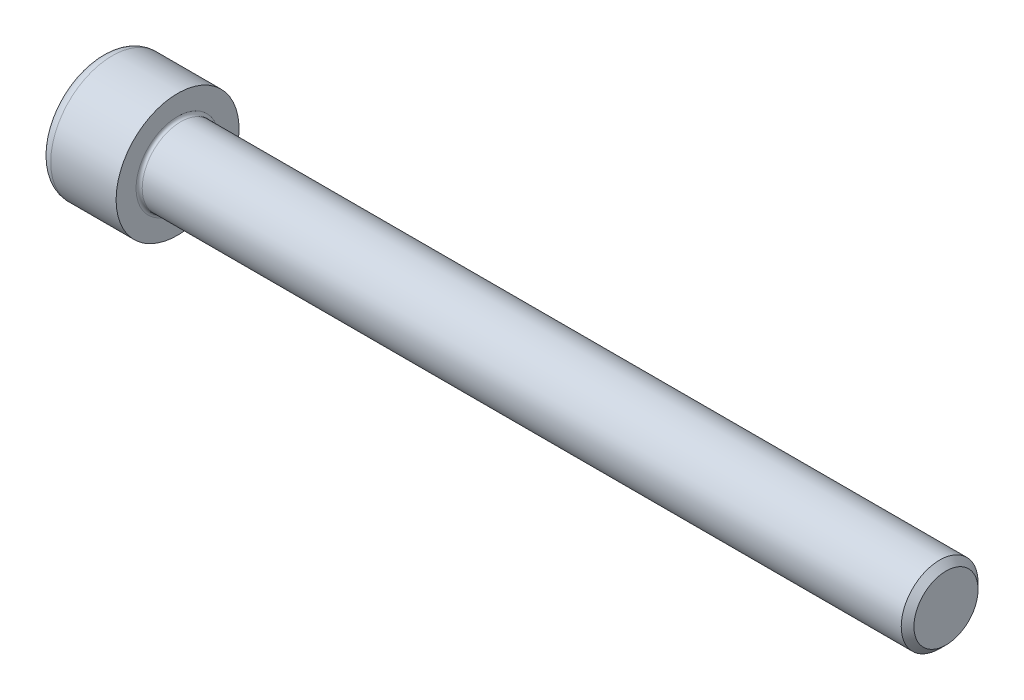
from build123d import *

# Parameters (mm, degrees)
FILLET1_R   = 0.4
FILLET2_R   = 1.5
HEX_2_DEPTH = 5


with BuildPart() as part:
    # BodySke → Base-Revolve (revolve)
    with BuildSketch(Plane.XY, mode=Mode.PRIVATE) as base_revolve_sk:
        Polygon((0, 0), (0, 8), (10, 8), (10, 5), (109.172, 5), (110, 4.172), (110, 0), align=None)
    revolve(base_revolve_sk.sketch.rotate(Axis((-31.75, 0, 0), (1, 0, 0)), 90), axis=Axis((-31.75, 0, 0), (1, 0, 0)))

    # Fillet1
    fillet1_edges = [part.edges().sort_by_distance(p)[0] for p in [
        (10, 0, -5),
    ]]
    fillet(fillet1_edges, radius=FILLET1_R)

    # Fillet2
    fillet2_edges = [part.edges().sort_by_distance(p)[0] for p in [
        (0, 0, -8),
    ]]
    fillet(fillet2_edges, radius=FILLET2_R)

    # Sketch2 → Hex-PreBroach (revolve, cut)
    with BuildSketch(Plane.XY, mode=Mode.PRIVATE) as hex_prebroach_sk:
        Polygon((0, 4.0575), (5, 4.0575), (7.342598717, 0), (0, 0), align=None)
    revolve(hex_prebroach_sk.sketch.rotate(Axis((0, 0, 0), (1, 0, 0)), 90), axis=Axis((0, 0, 0), (1, 0, 0)), mode=Mode.SUBTRACT)

    # Sketch3 → Hex 2 (cut)
    with BuildSketch(Plane(origin=(0, 0, 0), x_dir=(0, 0.500000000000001, 0.866025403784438), z_dir=(-1, 0, 0))):
        Polygon((2.342598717, 4.0575), (-2.342598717, 4.0575), (-4.685197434, 0), (-2.342598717, -4.0575), (2.342598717, -4.0575), (4.685197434, 0), align=None)
    extrude(amount=-HEX_2_DEPTH, mode=Mode.SUBTRACT)


solid = part.part
